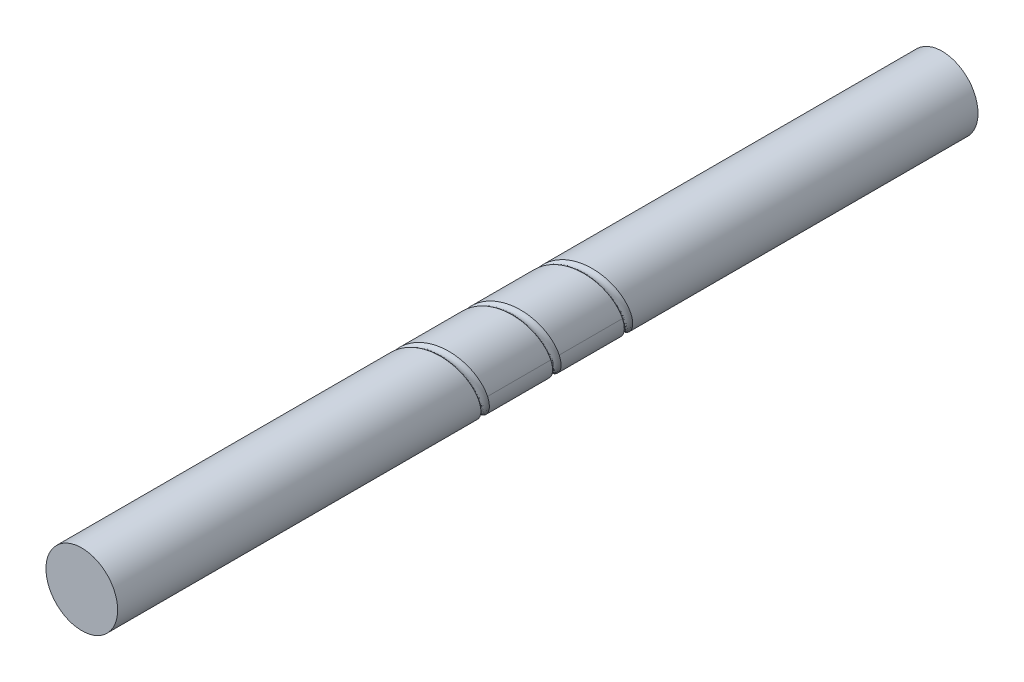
from build123d import *

# Parameters (mm, degrees)
SKETCH1_R              = 25
BOSS_EXTRUDE1_DEPTH    = 600
CUT_SWEEP1_PITCH       = 50
CUT_SWEEP1_HEIGHT      = 160
CUT_SWEEP1_RADIUS      = 27.646
CUT_SWEEP1_START_ANGLE = -180
SKETCH3_R              = 3.969


with BuildPart() as part:
    # Sketch1 → Boss-Extrude1 (new body)
    with BuildSketch(Plane.XY):
        Circle(SKETCH1_R)
    extrude(amount=BOSS_EXTRUDE1_DEPTH)

    # Cut-Sweep1: sweep along a helix
    with BuildLine() as cut_sweep1_path:
        add(Helix(CUT_SWEEP1_PITCH, CUT_SWEEP1_HEIGHT, CUT_SWEEP1_RADIUS, center=(0, 0, 220), direction=(0, 0, 1), mode=Mode.PRIVATE).rotate(Axis((0, 0, 220), (0, 0, 1)), CUT_SWEEP1_START_ANGLE))
    # Sketch3 → Cut-Sweep1 (sweep, cut)
    with BuildSketch(Plane(origin=(0, 0, 0), x_dir=(1, 0, 0), z_dir=(0, 1, 0))):
        with Locations((-27.646, -220)):
            Circle(SKETCH3_R)
    sweep(path=cut_sweep1_path.line, is_frenet=True, mode=Mode.SUBTRACT)


solid = part.part
